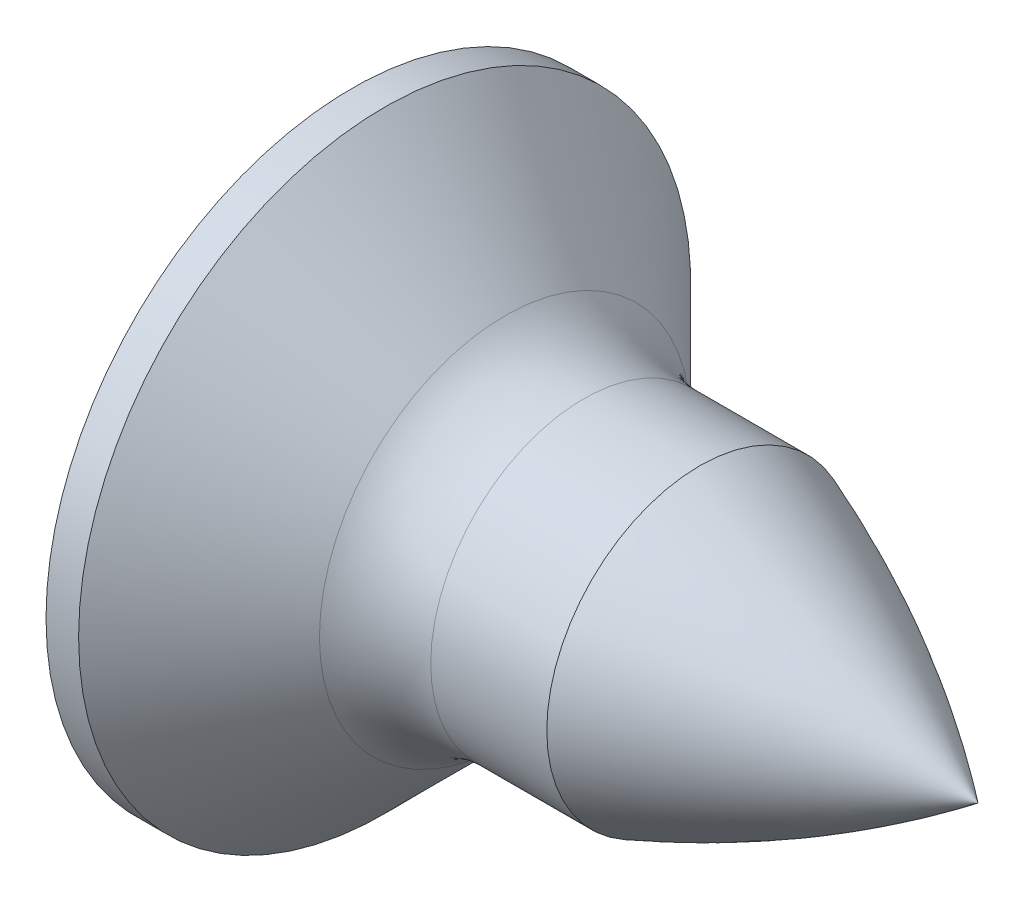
ISO-10303-21;
HEADER;
FILE_DESCRIPTION(('STEP AP214'),'2;1');
FILE_NAME('part.step','',(''),(''),'','','');
FILE_SCHEMA(('AUTOMOTIVE_DESIGN { 1 0 10303 214 1 1 1 1 }'));
ENDSEC;
DATA;
#1=APPLICATION_CONTEXT('core data for automotive mechanical design processes');
#2=APPLICATION_PROTOCOL_DEFINITION('international standard','automotive_design',2000,#1);
#3=PRODUCT_CONTEXT('',#1,'mechanical');
#4=PRODUCT('Part','Part','',(#3));
#5=PRODUCT_RELATED_PRODUCT_CATEGORY('part','',(#4));
#6=PRODUCT_DEFINITION_FORMATION('','',#4);
#7=PRODUCT_DEFINITION_CONTEXT('part definition',#1,'design');
#8=PRODUCT_DEFINITION('design','',#6,#7);
#9=PRODUCT_DEFINITION_SHAPE('','',#8);
#10=(LENGTH_UNIT() NAMED_UNIT(*) SI_UNIT(.MILLI.,.METRE.));
#11=(NAMED_UNIT(*) PLANE_ANGLE_UNIT() SI_UNIT($,.RADIAN.));
#12=(NAMED_UNIT(*) SI_UNIT($,.STERADIAN.) SOLID_ANGLE_UNIT());
#13=UNCERTAINTY_MEASURE_WITH_UNIT(LENGTH_MEASURE(1.E-05),#10,'distance_accuracy_value','');
#14=(GEOMETRIC_REPRESENTATION_CONTEXT(3) GLOBAL_UNCERTAINTY_ASSIGNED_CONTEXT((#13)) GLOBAL_UNIT_ASSIGNED_CONTEXT((#10,
#11,#12)) REPRESENTATION_CONTEXT('',''));
#15=CARTESIAN_POINT('',(0.,0.,0.));
#16=DIRECTION('',(0.,0.,1.));
#17=DIRECTION('',(1.,0.,0.));
#18=AXIS2_PLACEMENT_3D('',#15,#16,#17);
#19=CARTESIAN_POINT('',(-20.4182283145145,0.,0.));
#20=DIRECTION('',(-1.,0.,0.));
#21=DIRECTION('',(0.,0.,1.));
#22=AXIS2_PLACEMENT_3D('',#19,#20,#21);
#23=CYLINDRICAL_SURFACE('',#22,1.09999999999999);
#24=CARTESIAN_POINT('',(2.16568542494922,0.,0.));
#25=DIRECTION('',(-1.,0.,0.));
#26=DIRECTION('',(0.,0.,1.));
#27=AXIS2_PLACEMENT_3D('',#24,#25,#26);
#28=CIRCLE('',#27,1.09999999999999);
#29=CARTESIAN_POINT('',(2.16568542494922,0.,1.09999999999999));
#30=VERTEX_POINT('',#29);
#31=EDGE_CURVE('E170',#30,#30,#28,.T.);
#32=ORIENTED_EDGE('',*,*,#31,.F.);
#33=EDGE_LOOP('',(#32));
#34=FACE_BOUND('',#33,.T.);
#35=CARTESIAN_POINT('',(3.,0.,0.));
#36=DIRECTION('',(1.,0.,0.));
#37=DIRECTION('',(0.,1.,0.));
#38=AXIS2_PLACEMENT_3D('',#35,#36,#37);
#39=CIRCLE('',#38,1.1);
#40=CARTESIAN_POINT('',(3.,1.09999999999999,0.));
#41=VERTEX_POINT('',#40);
#42=EDGE_CURVE('E250',#41,#41,#39,.T.);
#43=ORIENTED_EDGE('',*,*,#42,.F.);
#44=EDGE_LOOP('',(#43));
#45=FACE_BOUND('',#44,.T.);
#46=ADVANCED_FACE('F37',(#34,#45),#23,.T.);
#47=CARTESIAN_POINT('',(5.09,0.,0.));
#48=DIRECTION('',(-1.,0.,0.));
#49=DIRECTION('',(0.,1.,0.));
#50=AXIS2_PLACEMENT_3D('',#47,#48,#49);
#51=SPHERICAL_SURFACE('',#50,5.09);
#52=CARTESIAN_POINT('',(0.5,0.,0.));
#53=DIRECTION('',(-1.,0.,0.));
#54=DIRECTION('',(0.,0.,1.));
#55=AXIS2_PLACEMENT_3D('',#52,#53,#54);
#56=CIRCLE('',#55,2.19999999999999);
#57=CARTESIAN_POINT('',(0.5,0.,2.19999999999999));
#58=VERTEX_POINT('',#57);
#59=EDGE_CURVE('E227',#58,#58,#56,.T.);
#60=ORIENTED_EDGE('',*,*,#59,.T.);
#61=EDGE_LOOP('',(#60));
#62=FACE_BOUND('',#61,.T.);
#63=CARTESIAN_POINT('',(5.09,0.,-0.220000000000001));
#64=DIRECTION('',(0.,0.,1.));
#65=DIRECTION('',(1.,0.,0.));
#66=AXIS2_PLACEMENT_3D('',#63,#64,#65);
#67=CIRCLE('',#66,5.08524335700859);
#68=CARTESIAN_POINT('',(0.111345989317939,1.0357143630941,-0.220000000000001));
#69=VERTEX_POINT('',#68);
#70=CARTESIAN_POINT('',(0.00951773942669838,0.219999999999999,-0.220000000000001));
#71=VERTEX_POINT('',#70);
#72=EDGE_CURVE('E11',#69,#71,#67,.T.);
#73=ORIENTED_EDGE('',*,*,#72,.F.);
#74=CARTESIAN_POINT('',(4.29381397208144,-1.3790346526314,0.));
#75=DIRECTION('',(-0.500000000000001,-0.866025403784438,0.));
#76=DIRECTION('',(0.866025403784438,-0.500000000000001,0.));
#77=AXIS2_PLACEMENT_3D('',#74,#75,#76);
#78=CIRCLE('',#77,4.83450630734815);
#79=CARTESIAN_POINT('',(0.111345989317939,1.0357143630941,0.219999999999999));
#80=VERTEX_POINT('',#79);
#81=EDGE_CURVE('E47',#80,#69,#78,.T.);
#82=ORIENTED_EDGE('',*,*,#81,.F.);
#83=CARTESIAN_POINT('',(5.09,0.,0.219999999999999));
#84=DIRECTION('',(0.,0.,-1.));
#85=DIRECTION('',(0.,1.,0.));
#86=AXIS2_PLACEMENT_3D('',#83,#84,#85);
#87=CIRCLE('',#86,5.08524335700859);
#88=CARTESIAN_POINT('',(0.00951773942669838,0.219999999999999,0.219999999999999));
#89=VERTEX_POINT('',#88);
#90=EDGE_CURVE('E166',#89,#80,#87,.T.);
#91=ORIENTED_EDGE('',*,*,#90,.F.);
#92=CARTESIAN_POINT('',(5.09,0.219999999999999,0.));
#93=DIRECTION('',(0.,-1.,0.));
#94=DIRECTION('',(0.,0.,-1.));
#95=AXIS2_PLACEMENT_3D('',#92,#93,#94);
#96=CIRCLE('',#95,5.08524335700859);
#97=CARTESIAN_POINT('',(0.111345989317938,0.219999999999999,1.0357143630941));
#98=VERTEX_POINT('',#97);
#99=EDGE_CURVE('E160',#98,#89,#96,.T.);
#100=ORIENTED_EDGE('',*,*,#99,.F.);
#101=CARTESIAN_POINT('',(4.29381397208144,0.,-1.3790346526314));
#102=DIRECTION('',(-0.500000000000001,0.,-0.866025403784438));
#103=DIRECTION('',(-0.866025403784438,0.,0.500000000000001));
#104=AXIS2_PLACEMENT_3D('',#101,#102,#103);
#105=CIRCLE('',#104,4.83450630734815);
#106=CARTESIAN_POINT('',(0.111345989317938,-0.220000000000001,1.0357143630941));
#107=VERTEX_POINT('',#106);
#108=EDGE_CURVE('E158',#107,#98,#105,.T.);
#109=ORIENTED_EDGE('',*,*,#108,.F.);
#110=CARTESIAN_POINT('',(5.09,-0.220000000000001,0.));
#111=DIRECTION('',(0.,1.,0.));
#112=DIRECTION('',(0.,0.,1.));
#113=AXIS2_PLACEMENT_3D('',#110,#111,#112);
#114=CIRCLE('',#113,5.08524335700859);
#115=CARTESIAN_POINT('',(0.00951773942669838,-0.220000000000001,0.219999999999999));
#116=VERTEX_POINT('',#115);
#117=EDGE_CURVE('E142',#116,#107,#114,.T.);
#118=ORIENTED_EDGE('',*,*,#117,.F.);
#119=CARTESIAN_POINT('',(5.09,0.,0.219999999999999));
#120=DIRECTION('',(0.,0.,-1.));
#121=DIRECTION('',(-1.,0.,0.));
#122=AXIS2_PLACEMENT_3D('',#119,#120,#121);
#123=CIRCLE('',#122,5.08524335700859);
#124=CARTESIAN_POINT('',(0.111345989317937,-1.0357143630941,0.219999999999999));
#125=VERTEX_POINT('',#124);
#126=EDGE_CURVE('E132',#125,#116,#123,.T.);
#127=ORIENTED_EDGE('',*,*,#126,.F.);
#128=CARTESIAN_POINT('',(4.29381397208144,1.3790346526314,0.));
#129=DIRECTION('',(-0.500000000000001,0.866025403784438,0.));
#130=DIRECTION('',(-0.866025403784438,-0.500000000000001,0.));
#131=AXIS2_PLACEMENT_3D('',#128,#129,#130);
#132=CIRCLE('',#131,4.83450630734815);
#133=CARTESIAN_POINT('',(0.111345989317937,-1.0357143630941,-0.220000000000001));
#134=VERTEX_POINT('',#133);
#135=EDGE_CURVE('E143',#134,#125,#132,.T.);
#136=ORIENTED_EDGE('',*,*,#135,.F.);
#137=CARTESIAN_POINT('',(5.09,0.,-0.220000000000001));
#138=DIRECTION('',(0.,0.,1.));
#139=DIRECTION('',(0.,-1.,0.));
#140=AXIS2_PLACEMENT_3D('',#137,#138,#139);
#141=CIRCLE('',#140,5.08524335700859);
#142=CARTESIAN_POINT('',(0.00951773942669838,-0.220000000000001,-0.220000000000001));
#143=VERTEX_POINT('',#142);
#144=EDGE_CURVE('E173',#143,#134,#141,.T.);
#145=ORIENTED_EDGE('',*,*,#144,.F.);
#146=CARTESIAN_POINT('',(5.09,-0.220000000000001,0.));
#147=DIRECTION('',(0.,1.,0.));
#148=DIRECTION('',(0.,0.,1.));
#149=AXIS2_PLACEMENT_3D('',#146,#147,#148);
#150=CIRCLE('',#149,5.08524335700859);
#151=CARTESIAN_POINT('',(0.111345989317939,-0.220000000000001,-1.0357143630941));
#152=VERTEX_POINT('',#151);
#153=EDGE_CURVE('E171',#152,#143,#150,.T.);
#154=ORIENTED_EDGE('',*,*,#153,.F.);
#155=CARTESIAN_POINT('',(4.29381397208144,0.,1.3790346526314));
#156=DIRECTION('',(-0.500000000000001,0.,0.866025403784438));
#157=DIRECTION('',(0.866025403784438,0.,0.500000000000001));
#158=AXIS2_PLACEMENT_3D('',#155,#156,#157);
#159=CIRCLE('',#158,4.83450630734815);
#160=CARTESIAN_POINT('',(0.111345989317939,0.219999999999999,-1.0357143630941));
#161=VERTEX_POINT('',#160);
#162=EDGE_CURVE('E169',#161,#152,#159,.T.);
#163=ORIENTED_EDGE('',*,*,#162,.F.);
#164=CARTESIAN_POINT('',(5.09,0.219999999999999,0.));
#165=DIRECTION('',(0.,-1.,0.));
#166=DIRECTION('',(0.,0.,-1.));
#167=AXIS2_PLACEMENT_3D('',#164,#165,#166);
#168=CIRCLE('',#167,5.08524335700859);
#169=EDGE_CURVE('E167',#71,#161,#168,.T.);
#170=ORIENTED_EDGE('',*,*,#169,.F.);
#171=EDGE_LOOP('',(#73,#82,#91,#100,#109,#118,#127,#136,#145,#154,#163,#170));
#172=FACE_BOUND('',#171,.T.);
#173=ADVANCED_FACE('F156',(#62,#172),#51,.T.);
#174=CARTESIAN_POINT('',(2.16568542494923,0.,0.));
#175=DIRECTION('',(-1.,0.,0.));
#176=DIRECTION('',(0.,0.,1.));
#177=AXIS2_PLACEMENT_3D('',#174,#175,#176);
#178=TOROIDAL_SURFACE('',#177,1.9,0.800000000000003);
#179=CARTESIAN_POINT('',(1.6,0.,0.));
#180=DIRECTION('',(-1.,0.,0.));
#181=DIRECTION('',(0.,0.,1.));
#182=AXIS2_PLACEMENT_3D('',#179,#180,#181);
#183=CIRCLE('',#182,1.33431457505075);
#184=CARTESIAN_POINT('',(1.6,0.,1.33431457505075));
#185=VERTEX_POINT('',#184);
#186=EDGE_CURVE('E194',#185,#185,#183,.T.);
#187=ORIENTED_EDGE('',*,*,#186,.F.);
#188=EDGE_LOOP('',(#187));
#189=FACE_BOUND('',#188,.T.);
#190=ORIENTED_EDGE('',*,*,#31,.T.);
#191=EDGE_LOOP('',(#190));
#192=FACE_BOUND('',#191,.T.);
#193=ADVANCED_FACE('F282',(#189,#192),#178,.F.);
#194=CARTESIAN_POINT('',(-20.4182283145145,0.,0.));
#195=DIRECTION('',(-1.,0.,0.));
#196=DIRECTION('',(0.,0.,1.));
#197=AXIS2_PLACEMENT_3D('',#194,#195,#196);
#198=CYLINDRICAL_SURFACE('',#197,2.19999999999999);
#199=ORIENTED_EDGE('',*,*,#59,.F.);
#200=EDGE_LOOP('',(#199));
#201=FACE_BOUND('',#200,.T.);
#202=CARTESIAN_POINT('',(0.734314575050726,0.,0.));
#203=DIRECTION('',(-1.,0.,0.));
#204=DIRECTION('',(0.,0.,1.));
#205=AXIS2_PLACEMENT_3D('',#202,#203,#204);
#206=CIRCLE('',#205,2.2);
#207=CARTESIAN_POINT('',(0.734314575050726,0.,2.2));
#208=VERTEX_POINT('',#207);
#209=EDGE_CURVE('E223',#208,#208,#206,.T.);
#210=ORIENTED_EDGE('',*,*,#209,.T.);
#211=EDGE_LOOP('',(#210));
#212=FACE_BOUND('',#211,.T.);
#213=ADVANCED_FACE('F290',(#201,#212),#198,.T.);
#214=CARTESIAN_POINT('',(1.6,0.,0.));
#215=DIRECTION('',(-1.,0.,0.));
#216=DIRECTION('',(0.,0.,1.));
#217=AXIS2_PLACEMENT_3D('',#214,#215,#216);
#218=CONICAL_SURFACE('',#217,1.33431457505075,0.78539816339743);
#219=ORIENTED_EDGE('',*,*,#209,.F.);
#220=EDGE_LOOP('',(#219));
#221=FACE_BOUND('',#220,.T.);
#222=ORIENTED_EDGE('',*,*,#186,.T.);
#223=EDGE_LOOP('',(#222));
#224=FACE_BOUND('',#223,.T.);
#225=ADVANCED_FACE('F358',(#221,#224),#218,.T.);
#226=CARTESIAN_POINT('',(1.2,1.1,-0.220000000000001));
#227=DIRECTION('',(0.,0.,1.));
#228=DIRECTION('',(1.,0.,0.));
#229=AXIS2_PLACEMENT_3D('',#226,#227,#228);
#230=PLANE('',#229);
#231=ORIENTED_EDGE('',*,*,#72,.T.);
#232=DIRECTION('',(-1.,0.,0.));
#233=VECTOR('',#232,1.);
#234=CARTESIAN_POINT('',(1.2,0.219999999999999,-0.220000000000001));
#235=LINE('',#234,#233);
#236=CARTESIAN_POINT('',(1.2,0.219999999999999,-0.220000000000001));
#237=VERTEX_POINT('',#236);
#238=EDGE_CURVE('E56',#237,#71,#235,.T.);
#239=ORIENTED_EDGE('',*,*,#238,.F.);
#240=DIRECTION('',(0.,1.,0.));
#241=VECTOR('',#240,1.);
#242=CARTESIAN_POINT('',(1.2,1.1,-0.220000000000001));
#243=LINE('',#242,#241);
#244=CARTESIAN_POINT('',(1.2,0.407179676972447,-0.220000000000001));
#245=VERTEX_POINT('',#244);
#246=EDGE_CURVE('E192',#237,#245,#243,.T.);
#247=ORIENTED_EDGE('',*,*,#246,.T.);
#248=DIRECTION('',(-0.866025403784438,0.500000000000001,0.));
#249=VECTOR('',#248,1.);
#250=CARTESIAN_POINT('',(0.,1.1,-0.220000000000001));
#251=LINE('',#250,#249);
#252=EDGE_CURVE('E187',#245,#69,#251,.T.);
#253=ORIENTED_EDGE('',*,*,#252,.T.);
#254=EDGE_LOOP('',(#231,#239,#247,#253));
#255=FACE_BOUND('',#254,.T.);
#256=ADVANCED_FACE('F245',(#255),#230,.T.);
#257=CARTESIAN_POINT('',(0.,1.1,0.));
#258=DIRECTION('',(-0.500000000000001,-0.866025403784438,0.));
#259=DIRECTION('',(0.866025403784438,-0.500000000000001,0.));
#260=AXIS2_PLACEMENT_3D('',#257,#258,#259);
#261=PLANE('',#260);
#262=ORIENTED_EDGE('',*,*,#81,.T.);
#263=ORIENTED_EDGE('',*,*,#252,.F.);
#264=DIRECTION('',(0.,0.,1.));
#265=VECTOR('',#264,1.);
#266=CARTESIAN_POINT('',(1.2,0.407179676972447,0.));
#267=LINE('',#266,#265);
#268=CARTESIAN_POINT('',(1.2,0.407179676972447,0.219999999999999));
#269=VERTEX_POINT('',#268);
#270=EDGE_CURVE('E189',#245,#269,#267,.T.);
#271=ORIENTED_EDGE('',*,*,#270,.T.);
#272=DIRECTION('',(-0.866025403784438,0.500000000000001,0.));
#273=VECTOR('',#272,1.);
#274=CARTESIAN_POINT('',(0.899999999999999,0.580384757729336,0.219999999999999));
#275=LINE('',#274,#273);
#276=EDGE_CURVE('E184',#269,#80,#275,.T.);
#277=ORIENTED_EDGE('',*,*,#276,.T.);
#278=EDGE_LOOP('',(#262,#263,#271,#277));
#279=FACE_BOUND('',#278,.T.);
#280=ADVANCED_FACE('F39',(#279),#261,.T.);
#281=CARTESIAN_POINT('',(1.2,1.1,0.219999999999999));
#282=DIRECTION('',(0.,0.,-1.));
#283=DIRECTION('',(0.,1.,0.));
#284=AXIS2_PLACEMENT_3D('',#281,#282,#283);
#285=PLANE('',#284);
#286=ORIENTED_EDGE('',*,*,#90,.T.);
#287=ORIENTED_EDGE('',*,*,#276,.F.);
#288=DIRECTION('',(0.,-1.,0.));
#289=VECTOR('',#288,1.);
#290=CARTESIAN_POINT('',(1.2,1.1,0.219999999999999));
#291=LINE('',#290,#289);
#292=CARTESIAN_POINT('',(1.2,0.219999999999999,0.219999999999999));
#293=VERTEX_POINT('',#292);
#294=EDGE_CURVE('E191',#269,#293,#291,.T.);
#295=ORIENTED_EDGE('',*,*,#294,.T.);
#296=DIRECTION('',(-1.,0.,0.));
#297=VECTOR('',#296,1.);
#298=CARTESIAN_POINT('',(1.2,0.219999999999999,0.219999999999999));
#299=LINE('',#298,#297);
#300=EDGE_CURVE('E188',#293,#89,#299,.T.);
#301=ORIENTED_EDGE('',*,*,#300,.T.);
#302=EDGE_LOOP('',(#286,#287,#295,#301));
#303=FACE_BOUND('',#302,.T.);
#304=ADVANCED_FACE('F235',(#303),#285,.T.);
#305=CARTESIAN_POINT('',(1.2,0.219999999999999,0.219999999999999));
#306=DIRECTION('',(0.,-1.,0.));
#307=DIRECTION('',(0.,0.,-1.));
#308=AXIS2_PLACEMENT_3D('',#305,#306,#307);
#309=PLANE('',#308);
#310=ORIENTED_EDGE('',*,*,#99,.T.);
#311=ORIENTED_EDGE('',*,*,#300,.F.);
#312=DIRECTION('',(0.,0.,1.));
#313=VECTOR('',#312,1.);
#314=CARTESIAN_POINT('',(1.2,0.219999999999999,0.219999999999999));
#315=LINE('',#314,#313);
#316=CARTESIAN_POINT('',(1.2,0.219999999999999,0.407179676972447));
#317=VERTEX_POINT('',#316);
#318=EDGE_CURVE('E200',#293,#317,#315,.T.);
#319=ORIENTED_EDGE('',*,*,#318,.T.);
#320=DIRECTION('',(-0.866025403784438,0.,0.500000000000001));
#321=VECTOR('',#320,1.);
#322=CARTESIAN_POINT('',(0.,0.219999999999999,1.1));
#323=LINE('',#322,#321);
#324=EDGE_CURVE('E197',#317,#98,#323,.T.);
#325=ORIENTED_EDGE('',*,*,#324,.T.);
#326=EDGE_LOOP('',(#310,#311,#319,#325));
#327=FACE_BOUND('',#326,.T.);
#328=ADVANCED_FACE('F296',(#327),#309,.T.);
#329=CARTESIAN_POINT('',(0.,0.,1.1));
#330=DIRECTION('',(-0.500000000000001,0.,-0.866025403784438));
#331=DIRECTION('',(-0.866025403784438,0.,0.500000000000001));
#332=AXIS2_PLACEMENT_3D('',#329,#330,#331);
#333=PLANE('',#332);
#334=ORIENTED_EDGE('',*,*,#108,.T.);
#335=ORIENTED_EDGE('',*,*,#324,.F.);
#336=DIRECTION('',(0.,-1.,0.));
#337=VECTOR('',#336,1.);
#338=CARTESIAN_POINT('',(1.2,0.,0.407179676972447));
#339=LINE('',#338,#337);
#340=CARTESIAN_POINT('',(1.2,-0.220000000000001,0.407179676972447));
#341=VERTEX_POINT('',#340);
#342=EDGE_CURVE('E198',#317,#341,#339,.T.);
#343=ORIENTED_EDGE('',*,*,#342,.T.);
#344=DIRECTION('',(-0.866025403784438,0.,0.500000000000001));
#345=VECTOR('',#344,1.);
#346=CARTESIAN_POINT('',(1.28105117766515,-0.220000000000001,0.360384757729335));
#347=LINE('',#346,#345);
#348=EDGE_CURVE('E152',#341,#107,#347,.T.);
#349=ORIENTED_EDGE('',*,*,#348,.T.);
#350=EDGE_LOOP('',(#334,#335,#343,#349));
#351=FACE_BOUND('',#350,.T.);
#352=ADVANCED_FACE('F294',(#351),#333,.T.);
#353=CARTESIAN_POINT('',(1.2,-0.220000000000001,0.219999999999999));
#354=DIRECTION('',(0.,1.,0.));
#355=DIRECTION('',(0.,0.,1.));
#356=AXIS2_PLACEMENT_3D('',#353,#354,#355);
#357=PLANE('',#356);
#358=ORIENTED_EDGE('',*,*,#117,.T.);
#359=ORIENTED_EDGE('',*,*,#348,.F.);
#360=DIRECTION('',(0.,0.,-1.));
#361=VECTOR('',#360,1.);
#362=CARTESIAN_POINT('',(1.2,-0.220000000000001,0.219999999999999));
#363=LINE('',#362,#361);
#364=CARTESIAN_POINT('',(1.2,-0.220000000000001,0.219999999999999));
#365=VERTEX_POINT('',#364);
#366=EDGE_CURVE('E151',#341,#365,#363,.T.);
#367=ORIENTED_EDGE('',*,*,#366,.T.);
#368=DIRECTION('',(-1.,0.,0.));
#369=VECTOR('',#368,1.);
#370=CARTESIAN_POINT('',(1.2,-0.220000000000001,0.219999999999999));
#371=LINE('',#370,#369);
#372=EDGE_CURVE('E135',#365,#116,#371,.T.);
#373=ORIENTED_EDGE('',*,*,#372,.T.);
#374=EDGE_LOOP('',(#358,#359,#367,#373));
#375=FACE_BOUND('',#374,.T.);
#376=ADVANCED_FACE('F147',(#375),#357,.T.);
#377=CARTESIAN_POINT('',(1.2,-1.1,0.219999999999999));
#378=DIRECTION('',(0.,0.,-1.));
#379=DIRECTION('',(-1.,0.,0.));
#380=AXIS2_PLACEMENT_3D('',#377,#378,#379);
#381=PLANE('',#380);
#382=ORIENTED_EDGE('',*,*,#126,.T.);
#383=ORIENTED_EDGE('',*,*,#372,.F.);
#384=DIRECTION('',(0.,-1.,0.));
#385=VECTOR('',#384,1.);
#386=CARTESIAN_POINT('',(1.2,-1.1,0.219999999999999));
#387=LINE('',#386,#385);
#388=CARTESIAN_POINT('',(1.2,-0.407179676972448,0.219999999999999));
#389=VERTEX_POINT('',#388);
#390=EDGE_CURVE('E181',#365,#389,#387,.T.);
#391=ORIENTED_EDGE('',*,*,#390,.T.);
#392=DIRECTION('',(-0.866025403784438,-0.500000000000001,0.));
#393=VECTOR('',#392,1.);
#394=CARTESIAN_POINT('',(0.,-1.1,0.219999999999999));
#395=LINE('',#394,#393);
#396=EDGE_CURVE('E138',#389,#125,#395,.T.);
#397=ORIENTED_EDGE('',*,*,#396,.T.);
#398=EDGE_LOOP('',(#382,#383,#391,#397));
#399=FACE_BOUND('',#398,.T.);
#400=ADVANCED_FACE('F134',(#399),#381,.T.);
#401=CARTESIAN_POINT('',(0.,-1.1,0.));
#402=DIRECTION('',(-0.500000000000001,0.866025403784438,0.));
#403=DIRECTION('',(-0.866025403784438,-0.500000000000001,0.));
#404=AXIS2_PLACEMENT_3D('',#401,#402,#403);
#405=PLANE('',#404);
#406=ORIENTED_EDGE('',*,*,#135,.T.);
#407=ORIENTED_EDGE('',*,*,#396,.F.);
#408=DIRECTION('',(0.,0.,-1.));
#409=VECTOR('',#408,1.);
#410=CARTESIAN_POINT('',(1.2,-0.407179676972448,0.));
#411=LINE('',#410,#409);
#412=CARTESIAN_POINT('',(1.2,-0.407179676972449,-0.220000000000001));
#413=VERTEX_POINT('',#412);
#414=EDGE_CURVE('E179',#389,#413,#411,.T.);
#415=ORIENTED_EDGE('',*,*,#414,.T.);
#416=DIRECTION('',(-0.866025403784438,-0.500000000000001,0.));
#417=VECTOR('',#416,1.);
#418=CARTESIAN_POINT('',(0.899999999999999,-0.580384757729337,-0.220000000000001));
#419=LINE('',#418,#417);
#420=EDGE_CURVE('E175',#413,#134,#419,.T.);
#421=ORIENTED_EDGE('',*,*,#420,.T.);
#422=EDGE_LOOP('',(#406,#407,#415,#421));
#423=FACE_BOUND('',#422,.T.);
#424=ADVANCED_FACE('F259',(#423),#405,.T.);
#425=CARTESIAN_POINT('',(1.2,-1.1,-0.220000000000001));
#426=DIRECTION('',(0.,0.,1.));
#427=DIRECTION('',(0.,-1.,0.));
#428=AXIS2_PLACEMENT_3D('',#425,#426,#427);
#429=PLANE('',#428);
#430=ORIENTED_EDGE('',*,*,#144,.T.);
#431=ORIENTED_EDGE('',*,*,#420,.F.);
#432=DIRECTION('',(0.,1.,0.));
#433=VECTOR('',#432,1.);
#434=CARTESIAN_POINT('',(1.2,-1.1,-0.220000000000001));
#435=LINE('',#434,#433);
#436=CARTESIAN_POINT('',(1.2,-0.220000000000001,-0.220000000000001));
#437=VERTEX_POINT('',#436);
#438=EDGE_CURVE('E121',#413,#437,#435,.T.);
#439=ORIENTED_EDGE('',*,*,#438,.T.);
#440=DIRECTION('',(-1.,0.,0.));
#441=VECTOR('',#440,1.);
#442=CARTESIAN_POINT('',(1.2,-0.220000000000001,-0.220000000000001));
#443=LINE('',#442,#441);
#444=EDGE_CURVE('E178',#437,#143,#443,.T.);
#445=ORIENTED_EDGE('',*,*,#444,.T.);
#446=EDGE_LOOP('',(#430,#431,#439,#445));
#447=FACE_BOUND('',#446,.T.);
#448=ADVANCED_FACE('F266',(#447),#429,.T.);
#449=CARTESIAN_POINT('',(1.2,-0.220000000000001,-0.220000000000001));
#450=DIRECTION('',(0.,1.,0.));
#451=DIRECTION('',(0.,0.,1.));
#452=AXIS2_PLACEMENT_3D('',#449,#450,#451);
#453=PLANE('',#452);
#454=ORIENTED_EDGE('',*,*,#153,.T.);
#455=ORIENTED_EDGE('',*,*,#444,.F.);
#456=DIRECTION('',(0.,0.,-1.));
#457=VECTOR('',#456,1.);
#458=CARTESIAN_POINT('',(1.2,-0.220000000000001,-0.220000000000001));
#459=LINE('',#458,#457);
#460=CARTESIAN_POINT('',(1.2,-0.220000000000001,-0.407179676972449));
#461=VERTEX_POINT('',#460);
#462=EDGE_CURVE('E113',#437,#461,#459,.T.);
#463=ORIENTED_EDGE('',*,*,#462,.T.);
#464=DIRECTION('',(-0.866025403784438,0.,-0.500000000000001));
#465=VECTOR('',#464,1.);
#466=CARTESIAN_POINT('',(0.,-0.220000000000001,-1.1));
#467=LINE('',#466,#465);
#468=EDGE_CURVE('E41',#461,#152,#467,.T.);
#469=ORIENTED_EDGE('',*,*,#468,.T.);
#470=EDGE_LOOP('',(#454,#455,#463,#469));
#471=FACE_BOUND('',#470,.T.);
#472=ADVANCED_FACE('F265',(#471),#453,.T.);
#473=CARTESIAN_POINT('',(0.,0.,-1.1));
#474=DIRECTION('',(-0.500000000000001,0.,0.866025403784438));
#475=DIRECTION('',(0.866025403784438,0.,0.500000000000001));
#476=AXIS2_PLACEMENT_3D('',#473,#474,#475);
#477=PLANE('',#476);
#478=ORIENTED_EDGE('',*,*,#162,.T.);
#479=ORIENTED_EDGE('',*,*,#468,.F.);
#480=DIRECTION('',(0.,1.,0.));
#481=VECTOR('',#480,1.);
#482=CARTESIAN_POINT('',(1.2,0.,-0.407179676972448));
#483=LINE('',#482,#481);
#484=CARTESIAN_POINT('',(1.2,0.219999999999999,-0.407179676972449));
#485=VERTEX_POINT('',#484);
#486=EDGE_CURVE('E207',#461,#485,#483,.T.);
#487=ORIENTED_EDGE('',*,*,#486,.T.);
#488=DIRECTION('',(-0.866025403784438,0.,-0.500000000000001));
#489=VECTOR('',#488,1.);
#490=CARTESIAN_POINT('',(1.28105117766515,0.219999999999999,-0.360384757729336));
#491=LINE('',#490,#489);
#492=EDGE_CURVE('E205',#485,#161,#491,.T.);
#493=ORIENTED_EDGE('',*,*,#492,.T.);
#494=EDGE_LOOP('',(#478,#479,#487,#493));
#495=FACE_BOUND('',#494,.T.);
#496=ADVANCED_FACE('F262',(#495),#477,.T.);
#497=CARTESIAN_POINT('',(1.2,0.219999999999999,-0.220000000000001));
#498=DIRECTION('',(0.,-1.,0.));
#499=DIRECTION('',(0.,0.,-1.));
#500=AXIS2_PLACEMENT_3D('',#497,#498,#499);
#501=PLANE('',#500);
#502=ORIENTED_EDGE('',*,*,#169,.T.);
#503=ORIENTED_EDGE('',*,*,#492,.F.);
#504=DIRECTION('',(0.,0.,1.));
#505=VECTOR('',#504,1.);
#506=CARTESIAN_POINT('',(1.2,0.219999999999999,-0.220000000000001));
#507=LINE('',#506,#505);
#508=EDGE_CURVE('E208',#485,#237,#507,.T.);
#509=ORIENTED_EDGE('',*,*,#508,.T.);
#510=ORIENTED_EDGE('',*,*,#238,.T.);
#511=EDGE_LOOP('',(#502,#503,#509,#510));
#512=FACE_BOUND('',#511,.T.);
#513=ADVANCED_FACE('F261',(#512),#501,.T.);
#514=CARTESIAN_POINT('',(1.2,-0.220000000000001,-0.220000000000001));
#515=DIRECTION('',(1.,0.,0.));
#516=DIRECTION('',(0.,0.,-1.));
#517=AXIS2_PLACEMENT_3D('',#514,#515,#516);
#518=PLANE('',#517);
#519=ORIENTED_EDGE('',*,*,#246,.F.);
#520=ORIENTED_EDGE('',*,*,#508,.F.);
#521=ORIENTED_EDGE('',*,*,#486,.F.);
#522=ORIENTED_EDGE('',*,*,#462,.F.);
#523=ORIENTED_EDGE('',*,*,#438,.F.);
#524=ORIENTED_EDGE('',*,*,#414,.F.);
#525=ORIENTED_EDGE('',*,*,#390,.F.);
#526=ORIENTED_EDGE('',*,*,#366,.F.);
#527=ORIENTED_EDGE('',*,*,#342,.F.);
#528=ORIENTED_EDGE('',*,*,#318,.F.);
#529=ORIENTED_EDGE('',*,*,#294,.F.);
#530=ORIENTED_EDGE('',*,*,#270,.F.);
#531=EDGE_LOOP('',(#519,#520,#521,#522,#523,#524,#525,#526,#527,#528,#529,#530));
#532=FACE_BOUND('',#531,.T.);
#533=ADVANCED_FACE('F260',(#532),#518,.F.);
#534=CARTESIAN_POINT('',(0.184082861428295,-6.38803116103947,0.));
#535=DIRECTION('',(0.,0.,-1.));
#536=DIRECTION('',(0.,1.,0.));
#537=AXIS2_PLACEMENT_3D('',#534,#535,#536);
#538=CIRCLE('',#537,8.);
#539=TRIMMED_CURVE('',#538,(PARAMETER_VALUE(-0.645990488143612)),
(PARAMETER_VALUE(0.645990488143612)),.T.,.PARAMETER.);
#540=CARTESIAN_POINT('',(0.184082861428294,0.,0.));
#541=DIRECTION('',(1.,0.,0.));
#542=AXIS1_PLACEMENT('',#540,#541);
#543=SURFACE_OF_REVOLUTION('',#539,#542);
#544=ORIENTED_EDGE('',*,*,#42,.T.);
#545=EDGE_LOOP('',(#544));
#546=FACE_BOUND('',#545,.T.);
#547=CARTESIAN_POINT('',(5.,0.,0.));
#548=VERTEX_POINT('',#547);
#549=VERTEX_LOOP('',#548);
#550=FACE_BOUND('',#549,.T.);
#551=ADVANCED_FACE('F311',(#546,#550),#543,.T.);
#552=CLOSED_SHELL('',(#46,#173,#193,#213,#225,#256,#280,#304,#328,#352,#376,#400,#424,#448,#472,
#496,#513,#533,#551));
#553=MANIFOLD_SOLID_BREP('B2',#552);
#554=ADVANCED_BREP_SHAPE_REPRESENTATION('',(#18,#553),#14);
#555=SHAPE_DEFINITION_REPRESENTATION(#9,#554);
ENDSEC;
END-ISO-10303-21;
